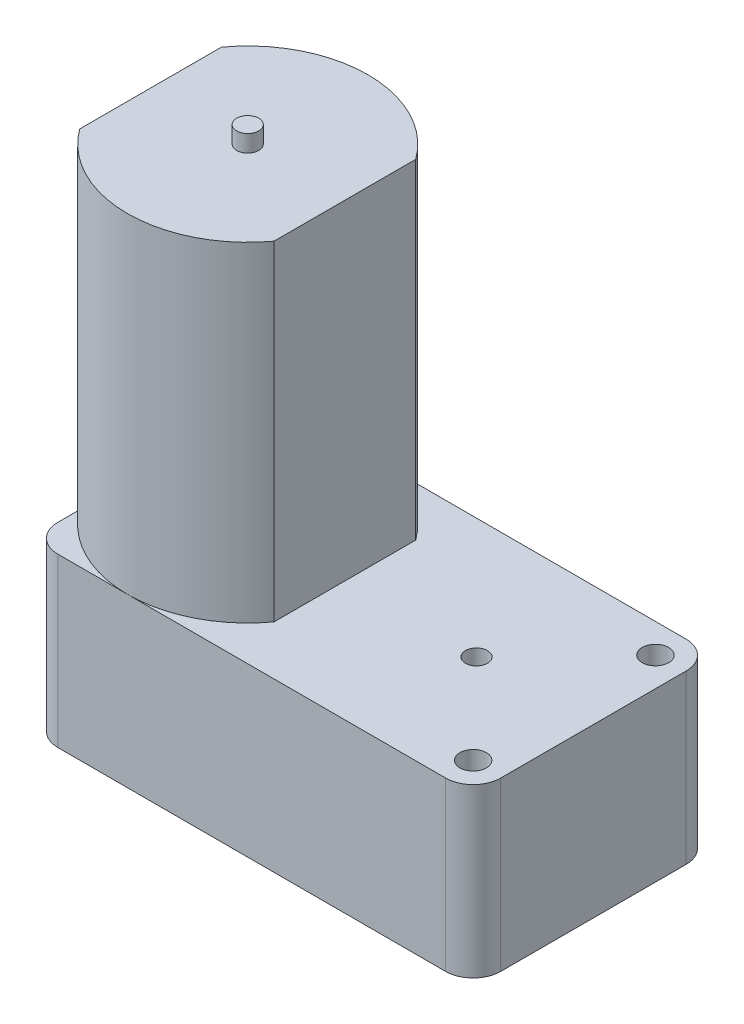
ISO-10303-21;
HEADER;
FILE_DESCRIPTION(('STEP AP214'),'2;1');
FILE_NAME('part.step','',(''),(''),'','','');
FILE_SCHEMA(('AUTOMOTIVE_DESIGN { 1 0 10303 214 1 1 1 1 }'));
ENDSEC;
DATA;
#1=APPLICATION_CONTEXT('core data for automotive mechanical design processes');
#2=APPLICATION_PROTOCOL_DEFINITION('international standard','automotive_design',2000,#1);
#3=PRODUCT_CONTEXT('',#1,'mechanical');
#4=PRODUCT('Part','Part','',(#3));
#5=PRODUCT_RELATED_PRODUCT_CATEGORY('part','',(#4));
#6=PRODUCT_DEFINITION_FORMATION('','',#4);
#7=PRODUCT_DEFINITION_CONTEXT('part definition',#1,'design');
#8=PRODUCT_DEFINITION('design','',#6,#7);
#9=PRODUCT_DEFINITION_SHAPE('','',#8);
#10=(LENGTH_UNIT() NAMED_UNIT(*) SI_UNIT(.MILLI.,.METRE.));
#11=(NAMED_UNIT(*) PLANE_ANGLE_UNIT() SI_UNIT($,.RADIAN.));
#12=(NAMED_UNIT(*) SI_UNIT($,.STERADIAN.) SOLID_ANGLE_UNIT());
#13=UNCERTAINTY_MEASURE_WITH_UNIT(LENGTH_MEASURE(1.E-05),#10,'distance_accuracy_value','');
#14=(GEOMETRIC_REPRESENTATION_CONTEXT(3) GLOBAL_UNCERTAINTY_ASSIGNED_CONTEXT((#13)) GLOBAL_UNIT_ASSIGNED_CONTEXT((#10,
#11,#12)) REPRESENTATION_CONTEXT('',''));
#15=CARTESIAN_POINT('',(0.,0.,0.));
#16=DIRECTION('',(0.,0.,1.));
#17=DIRECTION('',(1.,0.,0.));
#18=AXIS2_PLACEMENT_3D('',#15,#16,#17);
#19=CARTESIAN_POINT('',(-11.73,48.53,0.));
#20=DIRECTION('',(0.,-1.,0.));
#21=DIRECTION('',(0.,0.,-1.));
#22=AXIS2_PLACEMENT_3D('',#19,#20,#21);
#23=CYLINDRICAL_SURFACE('',#22,1.04);
#24=CARTESIAN_POINT('',(-11.73,48.53,0.));
#25=DIRECTION('',(0.,1.,0.));
#26=DIRECTION('',(0.,0.,1.));
#27=AXIS2_PLACEMENT_3D('',#24,#25,#26);
#28=CIRCLE('',#27,1.04);
#29=CARTESIAN_POINT('',(-11.73,48.53,1.04));
#30=VERTEX_POINT('',#29);
#31=EDGE_CURVE('E11',#30,#30,#28,.T.);
#32=ORIENTED_EDGE('',*,*,#31,.F.);
#33=EDGE_LOOP('',(#32));
#34=FACE_BOUND('',#33,.T.);
#35=CARTESIAN_POINT('',(-11.73,46.93,0.));
#36=DIRECTION('',(0.,1.,0.));
#37=DIRECTION('',(0.,0.,1.));
#38=AXIS2_PLACEMENT_3D('',#35,#36,#37);
#39=CIRCLE('',#38,1.04);
#40=CARTESIAN_POINT('',(-11.73,46.93,1.04));
#41=VERTEX_POINT('',#40);
#42=EDGE_CURVE('E45',#41,#41,#39,.T.);
#43=ORIENTED_EDGE('',*,*,#42,.T.);
#44=EDGE_LOOP('',(#43));
#45=FACE_BOUND('',#44,.T.);
#46=ADVANCED_FACE('F42',(#34,#45),#23,.T.);
#47=CARTESIAN_POINT('',(-11.73,48.53,0.));
#48=DIRECTION('',(0.,1.,0.));
#49=DIRECTION('',(0.,0.,1.));
#50=AXIS2_PLACEMENT_3D('',#47,#48,#49);
#51=PLANE('',#50);
#52=ORIENTED_EDGE('',*,*,#31,.T.);
#53=EDGE_LOOP('',(#52));
#54=FACE_BOUND('',#53,.T.);
#55=ADVANCED_FACE('F57',(#54),#51,.T.);
#56=CARTESIAN_POINT('',(-11.73,46.93,0.));
#57=DIRECTION('',(0.,1.,0.));
#58=DIRECTION('',(0.,0.,1.));
#59=AXIS2_PLACEMENT_3D('',#56,#57,#58);
#60=PLANE('',#59);
#61=ORIENTED_EDGE('',*,*,#42,.F.);
#62=EDGE_LOOP('',(#61));
#63=FACE_BOUND('',#62,.T.);
#64=ADVANCED_FACE('F55',(#63),#60,.F.);
#65=CLOSED_SHELL('',(#46,#55,#64));
#66=MANIFOLD_SOLID_BREP('B2',#65);
#67=CARTESIAN_POINT('',(-11.73,46.93,0.));
#68=DIRECTION('',(0.,-1.,0.));
#69=DIRECTION('',(0.,0.,-1.));
#70=AXIS2_PLACEMENT_3D('',#67,#68,#69);
#71=CYLINDRICAL_SURFACE('',#70,11.35);
#72=CARTESIAN_POINT('',(-11.73,15.81,0.));
#73=DIRECTION('',(0.,1.,0.));
#74=DIRECTION('',(0.,0.,1.));
#75=AXIS2_PLACEMENT_3D('',#72,#73,#74);
#76=CIRCLE('',#75,11.35);
#77=CARTESIAN_POINT('',(-2.56,15.81,-6.68831817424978));
#78=VERTEX_POINT('',#77);
#79=CARTESIAN_POINT('',(-20.9,15.81,-6.68831817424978));
#80=VERTEX_POINT('',#79);
#81=EDGE_CURVE('E155',#78,#80,#76,.T.);
#82=ORIENTED_EDGE('',*,*,#81,.T.);
#83=DIRECTION('',(0.,-1.,0.));
#84=VECTOR('',#83,1.);
#85=CARTESIAN_POINT('',(-20.9,46.93,-6.68831817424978));
#86=LINE('',#85,#84);
#87=CARTESIAN_POINT('',(-20.9,46.93,-6.68831817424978));
#88=VERTEX_POINT('',#87);
#89=EDGE_CURVE('E40',#88,#80,#86,.T.);
#90=ORIENTED_EDGE('',*,*,#89,.F.);
#91=CARTESIAN_POINT('',(-11.73,46.93,0.));
#92=DIRECTION('',(0.,1.,0.));
#93=DIRECTION('',(0.,0.,1.));
#94=AXIS2_PLACEMENT_3D('',#91,#92,#93);
#95=CIRCLE('',#94,11.35);
#96=CARTESIAN_POINT('',(-2.56,46.93,-6.68831817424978));
#97=VERTEX_POINT('',#96);
#98=EDGE_CURVE('E143',#97,#88,#95,.T.);
#99=ORIENTED_EDGE('',*,*,#98,.F.);
#100=DIRECTION('',(0.,-1.,0.));
#101=VECTOR('',#100,1.);
#102=CARTESIAN_POINT('',(-2.56,46.93,-6.68831817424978));
#103=LINE('',#102,#101);
#104=EDGE_CURVE('E151',#97,#78,#103,.T.);
#105=ORIENTED_EDGE('',*,*,#104,.T.);
#106=EDGE_LOOP('',(#82,#90,#99,#105));
#107=FACE_BOUND('',#106,.T.);
#108=ADVANCED_FACE('F92',(#107),#71,.T.);
#109=CARTESIAN_POINT('',(-20.9,46.93,-6.68831817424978));
#110=DIRECTION('',(1.,0.,0.));
#111=DIRECTION('',(0.,0.,-1.));
#112=AXIS2_PLACEMENT_3D('',#109,#110,#111);
#113=PLANE('',#112);
#114=DIRECTION('',(0.,0.,1.));
#115=VECTOR('',#114,1.);
#116=CARTESIAN_POINT('',(-20.9,15.81,-6.68831817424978));
#117=LINE('',#116,#115);
#118=CARTESIAN_POINT('',(-20.9,15.81,6.68831817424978));
#119=VERTEX_POINT('',#118);
#120=EDGE_CURVE('E147',#80,#119,#117,.T.);
#121=ORIENTED_EDGE('',*,*,#120,.T.);
#122=DIRECTION('',(0.,-1.,0.));
#123=VECTOR('',#122,1.);
#124=CARTESIAN_POINT('',(-20.9,46.93,6.68831817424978));
#125=LINE('',#124,#123);
#126=CARTESIAN_POINT('',(-20.9,46.93,6.68831817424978));
#127=VERTEX_POINT('',#126);
#128=EDGE_CURVE('E100',#127,#119,#125,.T.);
#129=ORIENTED_EDGE('',*,*,#128,.F.);
#130=DIRECTION('',(0.,0.,1.));
#131=VECTOR('',#130,1.);
#132=CARTESIAN_POINT('',(-20.9,46.93,-6.68831817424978));
#133=LINE('',#132,#131);
#134=EDGE_CURVE('E138',#88,#127,#133,.T.);
#135=ORIENTED_EDGE('',*,*,#134,.F.);
#136=ORIENTED_EDGE('',*,*,#89,.T.);
#137=EDGE_LOOP('',(#121,#129,#135,#136));
#138=FACE_BOUND('',#137,.T.);
#139=ADVANCED_FACE('F146',(#138),#113,.F.);
#140=CARTESIAN_POINT('',(-11.73,46.93,0.));
#141=DIRECTION('',(0.,-1.,0.));
#142=DIRECTION('',(0.,0.,-1.));
#143=AXIS2_PLACEMENT_3D('',#140,#141,#142);
#144=CYLINDRICAL_SURFACE('',#143,11.35);
#145=CARTESIAN_POINT('',(-11.73,15.81,0.));
#146=DIRECTION('',(0.,1.,0.));
#147=DIRECTION('',(0.,0.,1.));
#148=AXIS2_PLACEMENT_3D('',#145,#146,#147);
#149=CIRCLE('',#148,11.35);
#150=CARTESIAN_POINT('',(-2.55999999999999,15.81,6.68831817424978));
#151=VERTEX_POINT('',#150);
#152=EDGE_CURVE('E125',#119,#151,#149,.T.);
#153=ORIENTED_EDGE('',*,*,#152,.T.);
#154=DIRECTION('',(0.,-1.,0.));
#155=VECTOR('',#154,1.);
#156=CARTESIAN_POINT('',(-2.55999999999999,46.93,6.68831817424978));
#157=LINE('',#156,#155);
#158=CARTESIAN_POINT('',(-2.55999999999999,46.93,6.68831817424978));
#159=VERTEX_POINT('',#158);
#160=EDGE_CURVE('E148',#159,#151,#157,.T.);
#161=ORIENTED_EDGE('',*,*,#160,.F.);
#162=CARTESIAN_POINT('',(-11.73,46.93,0.));
#163=DIRECTION('',(0.,1.,0.));
#164=DIRECTION('',(0.,0.,1.));
#165=AXIS2_PLACEMENT_3D('',#162,#163,#164);
#166=CIRCLE('',#165,11.35);
#167=EDGE_CURVE('E141',#127,#159,#166,.T.);
#168=ORIENTED_EDGE('',*,*,#167,.F.);
#169=ORIENTED_EDGE('',*,*,#128,.T.);
#170=EDGE_LOOP('',(#153,#161,#168,#169));
#171=FACE_BOUND('',#170,.T.);
#172=ADVANCED_FACE('F149',(#171),#144,.T.);
#173=CARTESIAN_POINT('',(-2.56,46.93,-6.68831817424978));
#174=DIRECTION('',(-1.,0.,0.));
#175=DIRECTION('',(0.,0.,1.));
#176=AXIS2_PLACEMENT_3D('',#173,#174,#175);
#177=PLANE('',#176);
#178=DIRECTION('',(0.,0.,-1.));
#179=VECTOR('',#178,1.);
#180=CARTESIAN_POINT('',(-2.56,15.81,-6.68831817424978));
#181=LINE('',#180,#179);
#182=EDGE_CURVE('E131',#151,#78,#181,.T.);
#183=ORIENTED_EDGE('',*,*,#182,.T.);
#184=ORIENTED_EDGE('',*,*,#104,.F.);
#185=DIRECTION('',(0.,0.,-1.));
#186=VECTOR('',#185,1.);
#187=CARTESIAN_POINT('',(-2.56,46.93,-6.68831817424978));
#188=LINE('',#187,#186);
#189=EDGE_CURVE('E108',#159,#97,#188,.T.);
#190=ORIENTED_EDGE('',*,*,#189,.F.);
#191=ORIENTED_EDGE('',*,*,#160,.T.);
#192=EDGE_LOOP('',(#183,#184,#190,#191));
#193=FACE_BOUND('',#192,.T.);
#194=ADVANCED_FACE('F162',(#193),#177,.F.);
#195=CARTESIAN_POINT('',(-11.73,46.93,0.));
#196=DIRECTION('',(0.,1.,0.));
#197=DIRECTION('',(0.,0.,1.));
#198=AXIS2_PLACEMENT_3D('',#195,#196,#197);
#199=PLANE('',#198);
#200=ORIENTED_EDGE('',*,*,#98,.T.);
#201=ORIENTED_EDGE('',*,*,#134,.T.);
#202=ORIENTED_EDGE('',*,*,#167,.T.);
#203=ORIENTED_EDGE('',*,*,#189,.T.);
#204=EDGE_LOOP('',(#200,#201,#202,#203));
#205=FACE_BOUND('',#204,.T.);
#206=ADVANCED_FACE('F139',(#205),#199,.T.);
#207=CARTESIAN_POINT('',(-11.73,15.81,0.));
#208=DIRECTION('',(0.,1.,0.));
#209=DIRECTION('',(0.,0.,1.));
#210=AXIS2_PLACEMENT_3D('',#207,#208,#209);
#211=PLANE('',#210);
#212=ORIENTED_EDGE('',*,*,#81,.F.);
#213=ORIENTED_EDGE('',*,*,#182,.F.);
#214=ORIENTED_EDGE('',*,*,#152,.F.);
#215=ORIENTED_EDGE('',*,*,#120,.F.);
#216=EDGE_LOOP('',(#212,#213,#214,#215));
#217=FACE_BOUND('',#216,.T.);
#218=ADVANCED_FACE('F165',(#217),#211,.F.);
#219=CLOSED_SHELL('',(#108,#139,#172,#194,#206,#218));
#220=MANIFOLD_SOLID_BREP('B6',#219);
#221=CARTESIAN_POINT('',(-20.9,0.,11.35));
#222=DIRECTION('',(0.,1.,0.));
#223=DIRECTION('',(0.,0.,1.));
#224=AXIS2_PLACEMENT_3D('',#221,#222,#223);
#225=PLANE('',#224);
#226=DIRECTION('',(1.,0.,0.));
#227=VECTOR('',#226,1.);
#228=CARTESIAN_POINT('',(-20.9,0.,11.35));
#229=LINE('',#228,#227);
#230=CARTESIAN_POINT('',(-18.3,0.,11.35));
#231=VERTEX_POINT('',#230);
#232=CARTESIAN_POINT('',(18.3,0.,11.35));
#233=VERTEX_POINT('',#232);
#234=EDGE_CURVE('E300',#231,#233,#229,.T.);
#235=ORIENTED_EDGE('',*,*,#234,.F.);
#236=CARTESIAN_POINT('',(-18.3,0.,8.75));
#237=DIRECTION('',(0.,1.,0.));
#238=DIRECTION('',(0.,0.,1.));
#239=AXIS2_PLACEMENT_3D('',#236,#237,#238);
#240=CIRCLE('',#239,2.6);
#241=CARTESIAN_POINT('',(-20.9,0.,8.75));
#242=VERTEX_POINT('',#241);
#243=EDGE_CURVE('E283',#231,#242,#240,.F.);
#244=ORIENTED_EDGE('',*,*,#243,.T.);
#245=DIRECTION('',(0.,0.,1.));
#246=VECTOR('',#245,1.);
#247=CARTESIAN_POINT('',(-20.9,0.,-11.35));
#248=LINE('',#247,#246);
#249=CARTESIAN_POINT('',(-20.9,0.,-8.75));
#250=VERTEX_POINT('',#249);
#251=EDGE_CURVE('E310',#250,#242,#248,.T.);
#252=ORIENTED_EDGE('',*,*,#251,.F.);
#253=CARTESIAN_POINT('',(-18.3,0.,-8.75));
#254=DIRECTION('',(0.,1.,0.));
#255=DIRECTION('',(0.,0.,1.));
#256=AXIS2_PLACEMENT_3D('',#253,#254,#255);
#257=CIRCLE('',#256,2.6);
#258=CARTESIAN_POINT('',(-18.3,0.,-11.35));
#259=VERTEX_POINT('',#258);
#260=EDGE_CURVE('E294',#250,#259,#257,.F.);
#261=ORIENTED_EDGE('',*,*,#260,.T.);
#262=DIRECTION('',(-1.,0.,0.));
#263=VECTOR('',#262,1.);
#264=CARTESIAN_POINT('',(-20.9,0.,-11.35));
#265=LINE('',#264,#263);
#266=CARTESIAN_POINT('',(18.3,0.,-11.35));
#267=VERTEX_POINT('',#266);
#268=EDGE_CURVE('E313',#267,#259,#265,.T.);
#269=ORIENTED_EDGE('',*,*,#268,.F.);
#270=CARTESIAN_POINT('',(18.3,0.,-8.75));
#271=DIRECTION('',(0.,1.,0.));
#272=DIRECTION('',(0.,0.,1.));
#273=AXIS2_PLACEMENT_3D('',#270,#271,#272);
#274=CIRCLE('',#273,2.6);
#275=CARTESIAN_POINT('',(20.9,0.,-8.75));
#276=VERTEX_POINT('',#275);
#277=EDGE_CURVE('E324',#267,#276,#274,.F.);
#278=ORIENTED_EDGE('',*,*,#277,.T.);
#279=DIRECTION('',(0.,0.,-1.));
#280=VECTOR('',#279,1.);
#281=CARTESIAN_POINT('',(20.9,0.,-11.35));
#282=LINE('',#281,#280);
#283=CARTESIAN_POINT('',(20.9,0.,8.75));
#284=VERTEX_POINT('',#283);
#285=EDGE_CURVE('E309',#284,#276,#282,.T.);
#286=ORIENTED_EDGE('',*,*,#285,.F.);
#287=CARTESIAN_POINT('',(18.3,0.,8.75));
#288=DIRECTION('',(0.,1.,0.));
#289=DIRECTION('',(0.,0.,1.));
#290=AXIS2_PLACEMENT_3D('',#287,#288,#289);
#291=CIRCLE('',#290,2.6);
#292=EDGE_CURVE('E304',#284,#233,#291,.F.);
#293=ORIENTED_EDGE('',*,*,#292,.T.);
#294=EDGE_LOOP('',(#235,#244,#252,#261,#269,#278,#286,#293));
#295=FACE_BOUND('',#294,.T.);
#296=CARTESIAN_POINT('',(18.15,0.,8.6));
#297=DIRECTION('',(0.,-1.,0.));
#298=DIRECTION('',(0.,0.,-1.));
#299=AXIS2_PLACEMENT_3D('',#296,#297,#298);
#300=CIRCLE('',#299,1.25);
#301=CARTESIAN_POINT('',(18.15,0.,7.35));
#302=VERTEX_POINT('',#301);
#303=EDGE_CURVE('E368',#302,#302,#300,.T.);
#304=ORIENTED_EDGE('',*,*,#303,.F.);
#305=EDGE_LOOP('',(#304));
#306=FACE_BOUND('',#305,.T.);
#307=CARTESIAN_POINT('',(18.15,0.,-8.6));
#308=DIRECTION('',(0.,-1.,0.));
#309=DIRECTION('',(0.,0.,-1.));
#310=AXIS2_PLACEMENT_3D('',#307,#308,#309);
#311=CIRCLE('',#310,1.25);
#312=CARTESIAN_POINT('',(18.15,0.,-9.85));
#313=VERTEX_POINT('',#312);
#314=EDGE_CURVE('E374',#313,#313,#311,.T.);
#315=ORIENTED_EDGE('',*,*,#314,.F.);
#316=EDGE_LOOP('',(#315));
#317=FACE_BOUND('',#316,.T.);
#318=CARTESIAN_POINT('',(9.86,0.,0.));
#319=DIRECTION('',(0.,-1.,0.));
#320=DIRECTION('',(0.,0.,-1.));
#321=AXIS2_PLACEMENT_3D('',#318,#319,#320);
#322=CIRCLE('',#321,1.04);
#323=CARTESIAN_POINT('',(9.86,0.,-1.04));
#324=VERTEX_POINT('',#323);
#325=EDGE_CURVE('E380',#324,#324,#322,.T.);
#326=ORIENTED_EDGE('',*,*,#325,.F.);
#327=EDGE_LOOP('',(#326));
#328=FACE_BOUND('',#327,.T.);
#329=CARTESIAN_POINT('',(-1.39,0.,0.));
#330=DIRECTION('',(0.,1.,0.));
#331=DIRECTION('',(0.,0.,1.));
#332=AXIS2_PLACEMENT_3D('',#329,#330,#331);
#333=CIRCLE('',#332,1.97);
#334=CARTESIAN_POINT('',(-1.39,0.,1.97));
#335=VERTEX_POINT('',#334);
#336=EDGE_CURVE('E90',#335,#335,#333,.F.);
#337=ORIENTED_EDGE('',*,*,#336,.F.);
#338=EDGE_LOOP('',(#337));
#339=FACE_BOUND('',#338,.T.);
#340=ADVANCED_FACE('F216',(#295,#306,#317,#328,#339),#225,.F.);
#341=CARTESIAN_POINT('',(-20.9,15.81,-11.35));
#342=DIRECTION('',(1.,0.,0.));
#343=DIRECTION('',(0.,0.,-1.));
#344=AXIS2_PLACEMENT_3D('',#341,#342,#343);
#345=PLANE('',#344);
#346=ORIENTED_EDGE('',*,*,#251,.T.);
#347=DIRECTION('',(0.,-1.,0.));
#348=VECTOR('',#347,1.);
#349=CARTESIAN_POINT('',(-20.9,15.81,8.75));
#350=LINE('',#349,#348);
#351=CARTESIAN_POINT('',(-20.9,15.81,8.75));
#352=VERTEX_POINT('',#351);
#353=EDGE_CURVE('E288',#242,#352,#350,.F.);
#354=ORIENTED_EDGE('',*,*,#353,.T.);
#355=DIRECTION('',(0.,0.,1.));
#356=VECTOR('',#355,1.);
#357=CARTESIAN_POINT('',(-20.9,15.81,-11.35));
#358=LINE('',#357,#356);
#359=CARTESIAN_POINT('',(-20.9,15.81,-8.75));
#360=VERTEX_POINT('',#359);
#361=EDGE_CURVE('E320',#360,#352,#358,.T.);
#362=ORIENTED_EDGE('',*,*,#361,.F.);
#363=DIRECTION('',(0.,-1.,0.));
#364=VECTOR('',#363,1.);
#365=CARTESIAN_POINT('',(-20.9,15.81,-8.75));
#366=LINE('',#365,#364);
#367=EDGE_CURVE('E293',#360,#250,#366,.T.);
#368=ORIENTED_EDGE('',*,*,#367,.T.);
#369=EDGE_LOOP('',(#346,#354,#362,#368));
#370=FACE_BOUND('',#369,.T.);
#371=ADVANCED_FACE('F364',(#370),#345,.F.);
#372=CARTESIAN_POINT('',(-20.9,15.81,11.35));
#373=DIRECTION('',(0.,0.,-1.));
#374=DIRECTION('',(-1.,0.,0.));
#375=AXIS2_PLACEMENT_3D('',#372,#373,#374);
#376=PLANE('',#375);
#377=DIRECTION('',(1.,0.,0.));
#378=VECTOR('',#377,1.);
#379=CARTESIAN_POINT('',(-20.9,15.81,11.35));
#380=LINE('',#379,#378);
#381=CARTESIAN_POINT('',(-18.3,15.81,11.35));
#382=VERTEX_POINT('',#381);
#383=CARTESIAN_POINT('',(18.3,15.81,11.35));
#384=VERTEX_POINT('',#383);
#385=EDGE_CURVE('E303',#382,#384,#380,.T.);
#386=ORIENTED_EDGE('',*,*,#385,.F.);
#387=DIRECTION('',(0.,-1.,0.));
#388=VECTOR('',#387,1.);
#389=CARTESIAN_POINT('',(-18.3,15.81,11.35));
#390=LINE('',#389,#388);
#391=EDGE_CURVE('E287',#382,#231,#390,.T.);
#392=ORIENTED_EDGE('',*,*,#391,.T.);
#393=ORIENTED_EDGE('',*,*,#234,.T.);
#394=DIRECTION('',(0.,-1.,0.));
#395=VECTOR('',#394,1.);
#396=CARTESIAN_POINT('',(18.3,15.81,11.35));
#397=LINE('',#396,#395);
#398=EDGE_CURVE('E305',#233,#384,#397,.F.);
#399=ORIENTED_EDGE('',*,*,#398,.T.);
#400=EDGE_LOOP('',(#386,#392,#393,#399));
#401=FACE_BOUND('',#400,.T.);
#402=ADVANCED_FACE('F299',(#401),#376,.F.);
#403=CARTESIAN_POINT('',(20.9,15.81,-11.35));
#404=DIRECTION('',(-1.,0.,0.));
#405=DIRECTION('',(0.,0.,1.));
#406=AXIS2_PLACEMENT_3D('',#403,#404,#405);
#407=PLANE('',#406);
#408=ORIENTED_EDGE('',*,*,#285,.T.);
#409=DIRECTION('',(0.,-1.,0.));
#410=VECTOR('',#409,1.);
#411=CARTESIAN_POINT('',(20.9,15.81,-8.75));
#412=LINE('',#411,#410);
#413=CARTESIAN_POINT('',(20.9,15.81,-8.75));
#414=VERTEX_POINT('',#413);
#415=EDGE_CURVE('E224',#276,#414,#412,.F.);
#416=ORIENTED_EDGE('',*,*,#415,.T.);
#417=DIRECTION('',(0.,0.,-1.));
#418=VECTOR('',#417,1.);
#419=CARTESIAN_POINT('',(20.9,15.81,-11.35));
#420=LINE('',#419,#418);
#421=CARTESIAN_POINT('',(20.9,15.81,8.75));
#422=VERTEX_POINT('',#421);
#423=EDGE_CURVE('E347',#422,#414,#420,.T.);
#424=ORIENTED_EDGE('',*,*,#423,.F.);
#425=DIRECTION('',(0.,-1.,0.));
#426=VECTOR('',#425,1.);
#427=CARTESIAN_POINT('',(20.9,15.81,8.75));
#428=LINE('',#427,#426);
#429=EDGE_CURVE('E341',#422,#284,#428,.T.);
#430=ORIENTED_EDGE('',*,*,#429,.T.);
#431=EDGE_LOOP('',(#408,#416,#424,#430));
#432=FACE_BOUND('',#431,.T.);
#433=ADVANCED_FACE('F346',(#432),#407,.F.);
#434=CARTESIAN_POINT('',(-20.9,15.81,-11.35));
#435=DIRECTION('',(0.,0.,1.));
#436=DIRECTION('',(1.,0.,0.));
#437=AXIS2_PLACEMENT_3D('',#434,#435,#436);
#438=PLANE('',#437);
#439=ORIENTED_EDGE('',*,*,#268,.T.);
#440=DIRECTION('',(0.,-1.,0.));
#441=VECTOR('',#440,1.);
#442=CARTESIAN_POINT('',(-18.3,15.81,-11.35));
#443=LINE('',#442,#441);
#444=CARTESIAN_POINT('',(-18.3,15.81,-11.35));
#445=VERTEX_POINT('',#444);
#446=EDGE_CURVE('E231',#259,#445,#443,.F.);
#447=ORIENTED_EDGE('',*,*,#446,.T.);
#448=DIRECTION('',(-1.,0.,0.));
#449=VECTOR('',#448,1.);
#450=CARTESIAN_POINT('',(-20.9,15.81,-11.35));
#451=LINE('',#450,#449);
#452=CARTESIAN_POINT('',(18.3,15.81,-11.35));
#453=VERTEX_POINT('',#452);
#454=EDGE_CURVE('E321',#453,#445,#451,.T.);
#455=ORIENTED_EDGE('',*,*,#454,.F.);
#456=DIRECTION('',(0.,-1.,0.));
#457=VECTOR('',#456,1.);
#458=CARTESIAN_POINT('',(18.3,15.81,-11.35));
#459=LINE('',#458,#457);
#460=EDGE_CURVE('E337',#453,#267,#459,.T.);
#461=ORIENTED_EDGE('',*,*,#460,.T.);
#462=EDGE_LOOP('',(#439,#447,#455,#461));
#463=FACE_BOUND('',#462,.T.);
#464=ADVANCED_FACE('F357',(#463),#438,.F.);
#465=CARTESIAN_POINT('',(-20.9,15.81,11.35));
#466=DIRECTION('',(0.,1.,0.));
#467=DIRECTION('',(0.,0.,1.));
#468=AXIS2_PLACEMENT_3D('',#465,#466,#467);
#469=PLANE('',#468);
#470=CARTESIAN_POINT('',(9.86,15.81,0.));
#471=DIRECTION('',(0.,-1.,0.));
#472=DIRECTION('',(0.,0.,-1.));
#473=AXIS2_PLACEMENT_3D('',#470,#471,#472);
#474=CIRCLE('',#473,1.04);
#475=CARTESIAN_POINT('',(9.86,15.81,-1.04));
#476=VERTEX_POINT('',#475);
#477=EDGE_CURVE('E377',#476,#476,#474,.T.);
#478=ORIENTED_EDGE('',*,*,#477,.T.);
#479=EDGE_LOOP('',(#478));
#480=FACE_BOUND('',#479,.T.);
#481=CARTESIAN_POINT('',(18.15,15.81,-8.6));
#482=DIRECTION('',(0.,-1.,0.));
#483=DIRECTION('',(0.,0.,-1.));
#484=AXIS2_PLACEMENT_3D('',#481,#482,#483);
#485=CIRCLE('',#484,1.25);
#486=CARTESIAN_POINT('',(18.15,15.81,-9.85));
#487=VERTEX_POINT('',#486);
#488=EDGE_CURVE('E371',#487,#487,#485,.T.);
#489=ORIENTED_EDGE('',*,*,#488,.T.);
#490=EDGE_LOOP('',(#489));
#491=FACE_BOUND('',#490,.T.);
#492=CARTESIAN_POINT('',(18.15,15.81,8.6));
#493=DIRECTION('',(0.,-1.,0.));
#494=DIRECTION('',(0.,0.,-1.));
#495=AXIS2_PLACEMENT_3D('',#492,#493,#494);
#496=CIRCLE('',#495,1.25);
#497=CARTESIAN_POINT('',(18.15,15.81,7.35));
#498=VERTEX_POINT('',#497);
#499=EDGE_CURVE('E315',#498,#498,#496,.T.);
#500=ORIENTED_EDGE('',*,*,#499,.T.);
#501=EDGE_LOOP('',(#500));
#502=FACE_BOUND('',#501,.T.);
#503=ORIENTED_EDGE('',*,*,#361,.T.);
#504=CARTESIAN_POINT('',(-18.3,15.81,8.75));
#505=DIRECTION('',(0.,1.,0.));
#506=DIRECTION('',(0.,0.,1.));
#507=AXIS2_PLACEMENT_3D('',#504,#505,#506);
#508=CIRCLE('',#507,2.6);
#509=EDGE_CURVE('E335',#352,#382,#508,.T.);
#510=ORIENTED_EDGE('',*,*,#509,.T.);
#511=ORIENTED_EDGE('',*,*,#385,.T.);
#512=CARTESIAN_POINT('',(18.3,15.81,8.75));
#513=DIRECTION('',(0.,1.,0.));
#514=DIRECTION('',(0.,0.,1.));
#515=AXIS2_PLACEMENT_3D('',#512,#513,#514);
#516=CIRCLE('',#515,2.6);
#517=EDGE_CURVE('E330',#384,#422,#516,.T.);
#518=ORIENTED_EDGE('',*,*,#517,.T.);
#519=ORIENTED_EDGE('',*,*,#423,.T.);
#520=CARTESIAN_POINT('',(18.3,15.81,-8.75));
#521=DIRECTION('',(0.,1.,0.));
#522=DIRECTION('',(0.,0.,1.));
#523=AXIS2_PLACEMENT_3D('',#520,#521,#522);
#524=CIRCLE('',#523,2.6);
#525=EDGE_CURVE('E238',#414,#453,#524,.T.);
#526=ORIENTED_EDGE('',*,*,#525,.T.);
#527=ORIENTED_EDGE('',*,*,#454,.T.);
#528=CARTESIAN_POINT('',(-18.3,15.81,-8.75));
#529=DIRECTION('',(0.,1.,0.));
#530=DIRECTION('',(0.,0.,1.));
#531=AXIS2_PLACEMENT_3D('',#528,#529,#530);
#532=CIRCLE('',#531,2.6);
#533=EDGE_CURVE('E333',#445,#360,#532,.T.);
#534=ORIENTED_EDGE('',*,*,#533,.T.);
#535=EDGE_LOOP('',(#503,#510,#511,#518,#519,#526,#527,#534));
#536=FACE_BOUND('',#535,.T.);
#537=ADVANCED_FACE('F351',(#480,#491,#502,#536),#469,.T.);
#538=CARTESIAN_POINT('',(18.15,15.81,8.6));
#539=DIRECTION('',(0.,-1.,0.));
#540=DIRECTION('',(0.,0.,-1.));
#541=AXIS2_PLACEMENT_3D('',#538,#539,#540);
#542=CYLINDRICAL_SURFACE('',#541,1.25);
#543=ORIENTED_EDGE('',*,*,#499,.F.);
#544=EDGE_LOOP('',(#543));
#545=FACE_BOUND('',#544,.T.);
#546=ORIENTED_EDGE('',*,*,#303,.T.);
#547=EDGE_LOOP('',(#546));
#548=FACE_BOUND('',#547,.T.);
#549=ADVANCED_FACE('F476',(#545,#548),#542,.F.);
#550=CARTESIAN_POINT('',(18.15,15.81,-8.6));
#551=DIRECTION('',(0.,-1.,0.));
#552=DIRECTION('',(0.,0.,-1.));
#553=AXIS2_PLACEMENT_3D('',#550,#551,#552);
#554=CYLINDRICAL_SURFACE('',#553,1.25);
#555=ORIENTED_EDGE('',*,*,#488,.F.);
#556=EDGE_LOOP('',(#555));
#557=FACE_BOUND('',#556,.T.);
#558=ORIENTED_EDGE('',*,*,#314,.T.);
#559=EDGE_LOOP('',(#558));
#560=FACE_BOUND('',#559,.T.);
#561=ADVANCED_FACE('F466',(#557,#560),#554,.F.);
#562=CARTESIAN_POINT('',(9.86,15.81,0.));
#563=DIRECTION('',(0.,-1.,0.));
#564=DIRECTION('',(0.,0.,-1.));
#565=AXIS2_PLACEMENT_3D('',#562,#563,#564);
#566=CYLINDRICAL_SURFACE('',#565,1.04);
#567=ORIENTED_EDGE('',*,*,#477,.F.);
#568=EDGE_LOOP('',(#567));
#569=FACE_BOUND('',#568,.T.);
#570=ORIENTED_EDGE('',*,*,#325,.T.);
#571=EDGE_LOOP('',(#570));
#572=FACE_BOUND('',#571,.T.);
#573=ADVANCED_FACE('F414',(#569,#572),#566,.F.);
#574=CARTESIAN_POINT('',(-18.3,15.81,8.75));
#575=DIRECTION('',(0.,-1.,0.));
#576=DIRECTION('',(0.,0.,-1.));
#577=AXIS2_PLACEMENT_3D('',#574,#575,#576);
#578=CYLINDRICAL_SURFACE('',#577,2.6);
#579=ORIENTED_EDGE('',*,*,#509,.F.);
#580=ORIENTED_EDGE('',*,*,#353,.F.);
#581=ORIENTED_EDGE('',*,*,#243,.F.);
#582=ORIENTED_EDGE('',*,*,#391,.F.);
#583=EDGE_LOOP('',(#579,#580,#581,#582));
#584=FACE_BOUND('',#583,.T.);
#585=ADVANCED_FACE('F286',(#584),#578,.T.);
#586=CARTESIAN_POINT('',(-18.3,15.81,-8.75));
#587=DIRECTION('',(0.,-1.,0.));
#588=DIRECTION('',(0.,0.,-1.));
#589=AXIS2_PLACEMENT_3D('',#586,#587,#588);
#590=CYLINDRICAL_SURFACE('',#589,2.6);
#591=ORIENTED_EDGE('',*,*,#533,.F.);
#592=ORIENTED_EDGE('',*,*,#446,.F.);
#593=ORIENTED_EDGE('',*,*,#260,.F.);
#594=ORIENTED_EDGE('',*,*,#367,.F.);
#595=EDGE_LOOP('',(#591,#592,#593,#594));
#596=FACE_BOUND('',#595,.T.);
#597=ADVANCED_FACE('F361',(#596),#590,.T.);
#598=CARTESIAN_POINT('',(18.3,15.81,-8.75));
#599=DIRECTION('',(0.,-1.,0.));
#600=DIRECTION('',(0.,0.,-1.));
#601=AXIS2_PLACEMENT_3D('',#598,#599,#600);
#602=CYLINDRICAL_SURFACE('',#601,2.6);
#603=ORIENTED_EDGE('',*,*,#525,.F.);
#604=ORIENTED_EDGE('',*,*,#415,.F.);
#605=ORIENTED_EDGE('',*,*,#277,.F.);
#606=ORIENTED_EDGE('',*,*,#460,.F.);
#607=EDGE_LOOP('',(#603,#604,#605,#606));
#608=FACE_BOUND('',#607,.T.);
#609=ADVANCED_FACE('F355',(#608),#602,.T.);
#610=CARTESIAN_POINT('',(18.3,15.81,8.75));
#611=DIRECTION('',(0.,-1.,0.));
#612=DIRECTION('',(0.,0.,-1.));
#613=AXIS2_PLACEMENT_3D('',#610,#611,#612);
#614=CYLINDRICAL_SURFACE('',#613,2.6);
#615=ORIENTED_EDGE('',*,*,#517,.F.);
#616=ORIENTED_EDGE('',*,*,#398,.F.);
#617=ORIENTED_EDGE('',*,*,#292,.F.);
#618=ORIENTED_EDGE('',*,*,#429,.F.);
#619=EDGE_LOOP('',(#615,#616,#617,#618));
#620=FACE_BOUND('',#619,.T.);
#621=ADVANCED_FACE('F218',(#620),#614,.T.);
#622=CARTESIAN_POINT('',(-1.39,-1.,0.));
#623=DIRECTION('',(0.,1.,0.));
#624=DIRECTION('',(0.,0.,1.));
#625=AXIS2_PLACEMENT_3D('',#622,#623,#624);
#626=CYLINDRICAL_SURFACE('',#625,1.97);
#627=CARTESIAN_POINT('',(-1.39,-1.,0.));
#628=DIRECTION('',(0.,-1.,0.));
#629=DIRECTION('',(0.,0.,-1.));
#630=AXIS2_PLACEMENT_3D('',#627,#628,#629);
#631=CIRCLE('',#630,1.97);
#632=CARTESIAN_POINT('',(-1.39,-1.,-1.97));
#633=VERTEX_POINT('',#632);
#634=EDGE_CURVE('E383',#633,#633,#631,.T.);
#635=ORIENTED_EDGE('',*,*,#634,.F.);
#636=EDGE_LOOP('',(#635));
#637=FACE_BOUND('',#636,.T.);
#638=ORIENTED_EDGE('',*,*,#336,.T.);
#639=EDGE_LOOP('',(#638));
#640=FACE_BOUND('',#639,.T.);
#641=ADVANCED_FACE('F391',(#637,#640),#626,.T.);
#642=CARTESIAN_POINT('',(-1.39,-1.,0.));
#643=DIRECTION('',(0.,-1.,0.));
#644=DIRECTION('',(0.,0.,-1.));
#645=AXIS2_PLACEMENT_3D('',#642,#643,#644);
#646=PLANE('',#645);
#647=ORIENTED_EDGE('',*,*,#634,.T.);
#648=EDGE_LOOP('',(#647));
#649=FACE_BOUND('',#648,.T.);
#650=ADVANCED_FACE('F389',(#649),#646,.T.);
#651=CLOSED_SHELL('',(#340,#371,#402,#433,#464,#537,#549,#561,#573,#585,#597,#609,#621,#641,#650));
#652=MANIFOLD_SOLID_BREP('B34',#651);
#653=ADVANCED_BREP_SHAPE_REPRESENTATION('',(#18,#66,#220,#652),#14);
#654=SHAPE_DEFINITION_REPRESENTATION(#9,#653);
ENDSEC;
END-ISO-10303-21;
